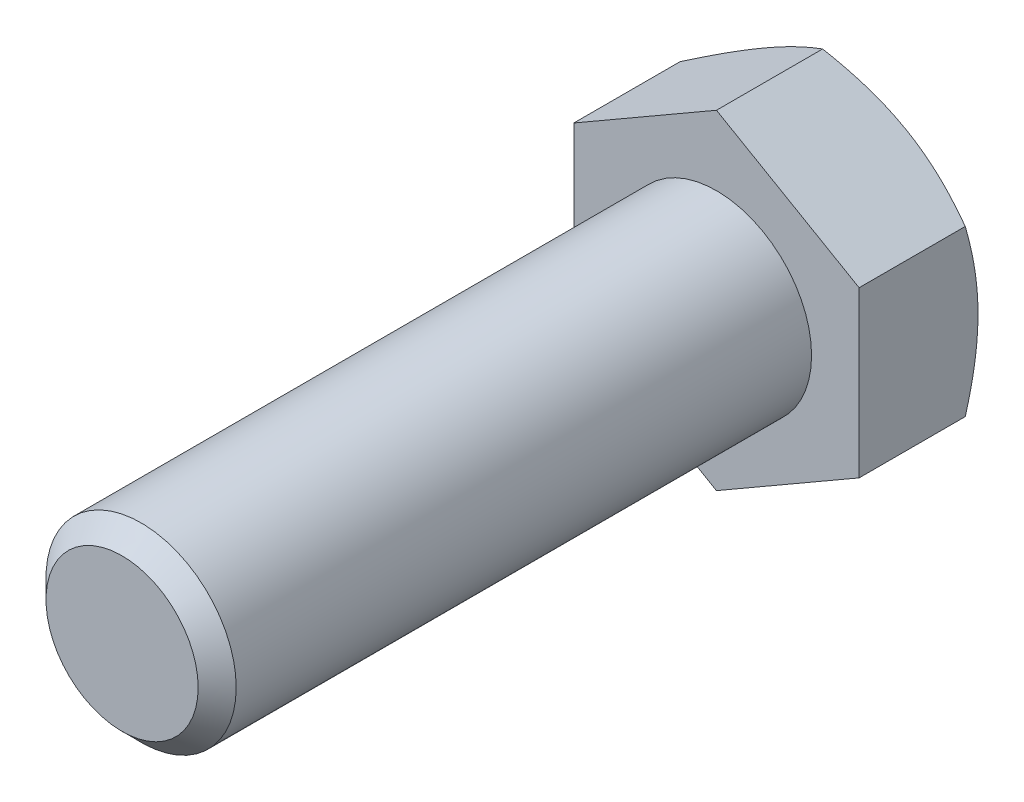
ISO-10303-21;
HEADER;
FILE_DESCRIPTION(('STEP AP214'),'2;1');
FILE_NAME('part.step','',(''),(''),'','','');
FILE_SCHEMA(('AUTOMOTIVE_DESIGN { 1 0 10303 214 1 1 1 1 }'));
ENDSEC;
DATA;
#1=APPLICATION_CONTEXT('core data for automotive mechanical design processes');
#2=APPLICATION_PROTOCOL_DEFINITION('international standard','automotive_design',2000,#1);
#3=PRODUCT_CONTEXT('',#1,'mechanical');
#4=PRODUCT('Part','Part','',(#3));
#5=PRODUCT_RELATED_PRODUCT_CATEGORY('part','',(#4));
#6=PRODUCT_DEFINITION_FORMATION('','',#4);
#7=PRODUCT_DEFINITION_CONTEXT('part definition',#1,'design');
#8=PRODUCT_DEFINITION('design','',#6,#7);
#9=PRODUCT_DEFINITION_SHAPE('','',#8);
#10=(LENGTH_UNIT() NAMED_UNIT(*) SI_UNIT(.MILLI.,.METRE.));
#11=(NAMED_UNIT(*) PLANE_ANGLE_UNIT() SI_UNIT($,.RADIAN.));
#12=(NAMED_UNIT(*) SI_UNIT($,.STERADIAN.) SOLID_ANGLE_UNIT());
#13=UNCERTAINTY_MEASURE_WITH_UNIT(LENGTH_MEASURE(1.E-05),#10,'distance_accuracy_value','');
#14=(GEOMETRIC_REPRESENTATION_CONTEXT(3) GLOBAL_UNCERTAINTY_ASSIGNED_CONTEXT((#13)) GLOBAL_UNIT_ASSIGNED_CONTEXT((#10,
#11,#12)) REPRESENTATION_CONTEXT('',''));
#15=CARTESIAN_POINT('',(0.,0.,0.));
#16=DIRECTION('',(0.,0.,1.));
#17=DIRECTION('',(1.,0.,0.));
#18=AXIS2_PLACEMENT_3D('',#15,#16,#17);
#19=CARTESIAN_POINT('',(3.7470027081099E-13,0.,50.));
#20=DIRECTION('',(0.,0.,1.));
#21=DIRECTION('',(1.,0.,0.));
#22=AXIS2_PLACEMENT_3D('',#19,#20,#21);
#23=PLANE('',#22);
#24=CARTESIAN_POINT('',(3.7470027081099E-13,0.,50.));
#25=DIRECTION('',(0.,0.,1.));
#26=DIRECTION('',(1.,0.,0.));
#27=AXIS2_PLACEMENT_3D('',#24,#25,#26);
#28=CIRCLE('',#27,6.40000000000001);
#29=CARTESIAN_POINT('',(6.40000000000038,0.,50.));
#30=VERTEX_POINT('',#29);
#31=EDGE_CURVE('E204',#30,#30,#28,.T.);
#32=ORIENTED_EDGE('',*,*,#31,.T.);
#33=EDGE_LOOP('',(#32));
#34=FACE_BOUND('',#33,.T.);
#35=ADVANCED_FACE('F30',(#34),#23,.T.);
#36=CARTESIAN_POINT('',(0.,0.,0.));
#37=DIRECTION('',(0.,0.,1.));
#38=DIRECTION('',(1.,0.,0.));
#39=AXIS2_PLACEMENT_3D('',#36,#37,#38);
#40=CYLINDRICAL_SURFACE('',#39,8.);
#41=CARTESIAN_POINT('',(2.63677968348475E-13,0.,48.4));
#42=DIRECTION('',(0.,0.,1.));
#43=DIRECTION('',(1.,0.,0.));
#44=AXIS2_PLACEMENT_3D('',#41,#42,#43);
#45=CIRCLE('',#44,8.);
#46=CARTESIAN_POINT('',(8.00000000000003,0.,48.4));
#47=VERTEX_POINT('',#46);
#48=EDGE_CURVE('E206',#47,#47,#45,.F.);
#49=CARTESIAN_POINT('',(0.,0.,0.));
#50=DIRECTION('',(0.,0.,1.));
#51=DIRECTION('',(0.999999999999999,0.,0.));
#52=AXIS2_PLACEMENT_3D('',#49,#50,#51);
#53=CIRCLE('',#52,8.);
#54=CARTESIAN_POINT('',(8.,0.,0.));
#55=VERTEX_POINT('',#54);
#56=EDGE_CURVE('E207',#55,#55,#53,.F.);
#57=CARTESIAN_POINT('',(8.00000000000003,0.,48.4));
#58=CARTESIAN_POINT('',(8.00000000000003,0.,47.8958333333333));
#59=CARTESIAN_POINT('',(8.00000000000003,0.,47.3916666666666));
#60=CARTESIAN_POINT('',(8.00000000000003,0.,46.3833333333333));
#61=CARTESIAN_POINT('',(8.00000000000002,0.,45.8791666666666));
#62=CARTESIAN_POINT('',(8.00000000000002,0.,44.8708333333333));
#63=CARTESIAN_POINT('',(8.00000000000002,0.,44.3666666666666));
#64=CARTESIAN_POINT('',(8.00000000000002,0.,43.3583333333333));
#65=CARTESIAN_POINT('',(8.00000000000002,0.,42.8541666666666));
#66=CARTESIAN_POINT('',(8.00000000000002,0.,41.8458333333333));
#67=CARTESIAN_POINT('',(8.00000000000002,0.,41.3416666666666));
#68=CARTESIAN_POINT('',(8.00000000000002,0.,40.3333333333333));
#69=CARTESIAN_POINT('',(8.00000000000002,0.,39.8291666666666));
#70=CARTESIAN_POINT('',(8.00000000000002,0.,38.8208333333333));
#71=CARTESIAN_POINT('',(8.00000000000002,0.,38.3166666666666));
#72=CARTESIAN_POINT('',(8.00000000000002,0.,37.3083333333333));
#73=CARTESIAN_POINT('',(8.00000000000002,0.,36.8041666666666));
#74=CARTESIAN_POINT('',(8.00000000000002,0.,35.7958333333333));
#75=CARTESIAN_POINT('',(8.00000000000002,0.,35.2916666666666));
#76=CARTESIAN_POINT('',(8.00000000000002,0.,34.2833333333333));
#77=CARTESIAN_POINT('',(8.00000000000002,0.,33.7791666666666));
#78=CARTESIAN_POINT('',(8.00000000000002,0.,32.7708333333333));
#79=CARTESIAN_POINT('',(8.00000000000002,0.,32.2666666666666));
#80=CARTESIAN_POINT('',(8.00000000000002,0.,31.2583333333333));
#81=CARTESIAN_POINT('',(8.00000000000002,0.,30.7541666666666));
#82=CARTESIAN_POINT('',(8.00000000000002,0.,29.7458333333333));
#83=CARTESIAN_POINT('',(8.00000000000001,0.,29.2416666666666));
#84=CARTESIAN_POINT('',(8.00000000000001,0.,28.2333333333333));
#85=CARTESIAN_POINT('',(8.00000000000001,0.,27.7291666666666));
#86=CARTESIAN_POINT('',(8.00000000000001,0.,26.7208333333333));
#87=CARTESIAN_POINT('',(8.00000000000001,0.,26.2166666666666));
#88=CARTESIAN_POINT('',(8.00000000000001,0.,25.2083333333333));
#89=CARTESIAN_POINT('',(8.00000000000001,0.,24.7041666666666));
#90=CARTESIAN_POINT('',(8.00000000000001,0.,23.6958333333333));
#91=CARTESIAN_POINT('',(8.00000000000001,0.,23.1916666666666));
#92=CARTESIAN_POINT('',(8.00000000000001,0.,22.1833333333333));
#93=CARTESIAN_POINT('',(8.00000000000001,0.,21.6791666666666));
#94=CARTESIAN_POINT('',(8.00000000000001,0.,20.6708333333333));
#95=CARTESIAN_POINT('',(8.00000000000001,0.,20.1666666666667));
#96=CARTESIAN_POINT('',(8.00000000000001,0.,19.1583333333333));
#97=CARTESIAN_POINT('',(8.00000000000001,0.,18.6541666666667));
#98=CARTESIAN_POINT('',(8.00000000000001,0.,17.6458333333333));
#99=CARTESIAN_POINT('',(8.00000000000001,0.,17.1416666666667));
#100=CARTESIAN_POINT('',(8.00000000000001,0.,16.1333333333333));
#101=CARTESIAN_POINT('',(8.00000000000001,0.,15.6291666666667));
#102=CARTESIAN_POINT('',(8.00000000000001,0.,14.6208333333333));
#103=CARTESIAN_POINT('',(8.00000000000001,0.,14.1166666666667));
#104=CARTESIAN_POINT('',(8.00000000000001,0.,13.1083333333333));
#105=CARTESIAN_POINT('',(8.,0.,12.6041666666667));
#106=CARTESIAN_POINT('',(8.,0.,11.5958333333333));
#107=CARTESIAN_POINT('',(8.,0.,11.0916666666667));
#108=CARTESIAN_POINT('',(8.,0.,10.0833333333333));
#109=CARTESIAN_POINT('',(8.,0.,9.57916666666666));
#110=CARTESIAN_POINT('',(8.,0.,8.57083333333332));
#111=CARTESIAN_POINT('',(8.,0.,8.06666666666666));
#112=CARTESIAN_POINT('',(8.,0.,7.05833333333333));
#113=CARTESIAN_POINT('',(8.,0.,6.55416666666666));
#114=CARTESIAN_POINT('',(8.,0.,5.54583333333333));
#115=CARTESIAN_POINT('',(8.,0.,5.04166666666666));
#116=CARTESIAN_POINT('',(8.,0.,4.03333333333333));
#117=CARTESIAN_POINT('',(8.,0.,3.52916666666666));
#118=CARTESIAN_POINT('',(8.,0.,2.52083333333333));
#119=CARTESIAN_POINT('',(8.,0.,2.01666666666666));
#120=CARTESIAN_POINT('',(8.,0.,1.00833333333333));
#121=CARTESIAN_POINT('',(8.,0.,0.504166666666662));
#122=CARTESIAN_POINT('',(8.,0.,0.));
#123=B_SPLINE_CURVE_WITH_KNOTS('',3,(#57,#58,#59,#60,#61,#62,#63,#64,#65,#66,#67,#68,#69,#70,
#71,#72,#73,#74,#75,#76,#77,#78,#79,#80,#81,#82,#83,#84,#85,#86,#87,#88,#89,#90,#91,#92,#93,#94,
#95,#96,#97,#98,#99,#100,#101,#102,#103,#104,#105,#106,#107,#108,#109,#110,#111,#112,#113,#114,
#115,#116,#117,#118,#119,#120,#121,#122),.UNSPECIFIED.,.F.,.F.,(4,2,2,2,2,2,2,2,2,2,2,2,2,2,2,2,
2,2,2,2,2,2,2,2,2,2,2,2,2,2,2,2,4),(0.,1.5125,3.02499999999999,4.53749999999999,
6.04999999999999,7.56249999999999,9.07499999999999,10.5875,12.1,13.6125,15.125,16.6375,18.15,
19.6625,21.175,22.6875,24.2,25.7125,27.225,28.7375,30.25,31.7625,33.275,34.7875,36.3,37.8125,
39.325,40.8375,42.35,43.8625,45.375,46.8875,48.4),.UNSPECIFIED.);
#124=EDGE_CURVE('BSEAM195',#47,#55,#123,.T.);
#125=ORIENTED_EDGE('',*,*,#48,.T.);
#126=ORIENTED_EDGE('',*,*,#56,.F.);
#127=ORIENTED_EDGE('',*,*,#124,.T.);
#128=ORIENTED_EDGE('',*,*,#124,.F.);
#129=EDGE_LOOP('',(#125,#127,#126,#128));
#130=FACE_BOUND('',#129,.T.);
#131=ADVANCED_FACE('F195',(#130),#40,.T.);
#132=CARTESIAN_POINT('',(3.7470027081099E-13,0.,50.));
#133=DIRECTION('',(0.,0.,-1.));
#134=DIRECTION('',(-1.,0.,0.));
#135=AXIS2_PLACEMENT_3D('',#132,#133,#134);
#136=CONICAL_SURFACE('',#135,6.40000000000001,0.785398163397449);
#137=ORIENTED_EDGE('',*,*,#48,.F.);
#138=EDGE_LOOP('',(#137));
#139=FACE_BOUND('',#138,.T.);
#140=ORIENTED_EDGE('',*,*,#31,.F.);
#141=EDGE_LOOP('',(#140));
#142=FACE_BOUND('',#141,.T.);
#143=ADVANCED_FACE('F200',(#139,#142),#136,.T.);
#144=CARTESIAN_POINT('',(1.14491749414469E-13,13.8564064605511,-9.99999999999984));
#145=DIRECTION('',(0.499999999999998,0.866025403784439,0.));
#146=DIRECTION('',(-0.86602540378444,0.499999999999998,0.));
#147=AXIS2_PLACEMENT_3D('',#144,#145,#146);
#148=PLANE('',#147);
#149=CARTESIAN_POINT('',(-0.000200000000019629,13.8565219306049,-8.92813656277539));
#150=CARTESIAN_POINT('',(0.263585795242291,13.7042251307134,-9.01605036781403));
#151=CARTESIAN_POINT('',(0.528355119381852,13.5513604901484,-9.09997400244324));
#152=CARTESIAN_POINT('',(1.06001701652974,13.2444053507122,-9.25873378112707));
#153=CARTESIAN_POINT('',(1.32691025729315,13.0903144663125,-9.33356693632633));
#154=CARTESIAN_POINT('',(2.13189040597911,12.6255589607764,-9.54298246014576));
#155=CARTESIAN_POINT('',(2.67315507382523,12.3130596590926,-9.66209676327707));
#156=CARTESIAN_POINT('',(3.48313282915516,11.8454187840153,-9.80176893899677));
#157=CARTESIAN_POINT('',(3.74942610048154,11.6916742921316,-9.84155620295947));
#158=CARTESIAN_POINT('',(4.28324559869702,11.3834734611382,-9.90827663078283));
#159=CARTESIAN_POINT('',(4.55077184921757,11.2290171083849,-9.93520954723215));
#160=CARTESIAN_POINT('',(5.08627036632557,10.9198468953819,-9.97553140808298));
#161=CARTESIAN_POINT('',(5.35424172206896,10.7651335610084,-9.98893644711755));
#162=CARTESIAN_POINT('',(5.89043273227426,10.4555635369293,-10.0019169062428));
#163=CARTESIAN_POINT('',(6.15865237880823,10.3007068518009,-10.0014927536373));
#164=CARTESIAN_POINT('',(6.6600893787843,10.0112020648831,-9.98777998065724));
#165=CARTESIAN_POINT('',(6.89334249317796,9.87653331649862,-9.97616401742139));
#166=CARTESIAN_POINT('',(7.35931224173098,9.60750555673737,-9.94269199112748));
#167=CARTESIAN_POINT('',(7.59202883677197,9.47314656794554,-9.92083520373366));
#168=CARTESIAN_POINT('',(8.05679907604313,9.204811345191,-9.86726258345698));
#169=CARTESIAN_POINT('',(8.28885201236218,9.07083551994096,-9.83553860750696));
#170=CARTESIAN_POINT('',(8.75186996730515,8.80351197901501,-9.76278822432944));
#171=CARTESIAN_POINT('',(8.9828349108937,8.67016430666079,-9.72176118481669));
#172=CARTESIAN_POINT('',(9.68394195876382,8.26537996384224,-9.58368834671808));
#173=CARTESIAN_POINT('',(10.1520537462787,7.99511549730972,-9.47287511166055));
#174=CARTESIAN_POINT('',(11.0812971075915,7.45861659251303,-9.22137423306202));
#175=CARTESIAN_POINT('',(11.5424405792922,7.19237528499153,-9.08074565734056));
#176=CARTESIAN_POINT('',(12.0002,6.92808776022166,-8.92813656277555));
#177=B_SPLINE_CURVE_WITH_KNOTS('',3,(#149,#150,#151,#152,#153,#154,#155,#156,#157,#158,#159,
#160,#161,#162,#163,#164,#165,#166,#167,#168,#169,#170,#171,#172,#173,#174,#175,#176),
.UNSPECIFIED.,.F.,.F.,(4,2,2,2,2,2,2,2,2,2,2,2,2,4),(0.,0.951004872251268,1.90232158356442,
3.8090046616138,4.73894551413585,5.66890426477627,6.59775529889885,7.52657763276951,
8.33514643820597,9.14377244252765,9.95306755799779,10.7624176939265,12.4167102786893,
14.0677556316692),.UNSPECIFIED.);
#178=CARTESIAN_POINT('',(0.,13.8564064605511,-8.92820323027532));
#179=VERTEX_POINT('',#178);
#180=CARTESIAN_POINT('',(6.00000000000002,10.3923048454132,-10.));
#181=VERTEX_POINT('',#180);
#182=EDGE_CURVE('E240',#179,#181,#177,.T.);
#183=ORIENTED_EDGE('',*,*,#182,.F.);
#184=DIRECTION('',(0.,0.,1.));
#185=VECTOR('',#184,1.);
#186=CARTESIAN_POINT('',(1.14491749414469E-13,13.8564064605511,-9.99999999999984));
#187=LINE('',#186,#185);
#188=CARTESIAN_POINT('',(1.2490009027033E-13,13.8564064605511,1.66533453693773E-13));
#189=VERTEX_POINT('',#188);
#190=EDGE_CURVE('E214',#179,#189,#187,.T.);
#191=ORIENTED_EDGE('',*,*,#190,.T.);
#192=DIRECTION('',(-0.86602540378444,0.499999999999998,0.));
#193=VECTOR('',#192,1.);
#194=CARTESIAN_POINT('',(1.2490009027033E-13,13.8564064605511,1.66533453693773E-13));
#195=LINE('',#194,#193);
#196=CARTESIAN_POINT('',(12.0000000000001,6.92820323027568,0.));
#197=VERTEX_POINT('',#196);
#198=EDGE_CURVE('E238',#197,#189,#195,.T.);
#199=ORIENTED_EDGE('',*,*,#198,.F.);
#200=DIRECTION('',(0.,0.,1.));
#201=VECTOR('',#200,1.);
#202=CARTESIAN_POINT('',(12.,6.92820323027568,-9.99999999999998));
#203=LINE('',#202,#201);
#204=CARTESIAN_POINT('',(12.,6.92820323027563,-8.92820323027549));
#205=VERTEX_POINT('',#204);
#206=EDGE_CURVE('E211',#205,#197,#203,.T.);
#207=ORIENTED_EDGE('',*,*,#206,.F.);
#208=EDGE_CURVE('E170',#181,#205,#177,.T.);
#209=ORIENTED_EDGE('',*,*,#208,.F.);
#210=EDGE_LOOP('',(#183,#191,#199,#207,#209));
#211=FACE_BOUND('',#210,.T.);
#212=ADVANCED_FACE('F180',(#211),#148,.T.);
#213=CARTESIAN_POINT('',(12.0000000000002,-6.92820323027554,-10.));
#214=DIRECTION('',(0.999999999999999,0.,0.));
#215=DIRECTION('',(0.,0.,-1.));
#216=AXIS2_PLACEMENT_3D('',#213,#214,#215);
#217=PLANE('',#216);
#218=CARTESIAN_POINT('',(12.0000000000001,-18.9250739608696,-3.99042361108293));
#219=CARTESIAN_POINT('',(12.0000000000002,-18.6616294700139,-4.11887459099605));
#220=CARTESIAN_POINT('',(12.0000000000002,-18.3978841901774,-4.24670838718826));
#221=CARTESIAN_POINT('',(12.0000000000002,-17.869729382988,-4.50100240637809));
#222=CARTESIAN_POINT('',(12.0000000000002,-17.6053198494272,-4.62746261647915));
#223=CARTESIAN_POINT('',(12.0000000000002,-16.8109346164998,-5.00460542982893));
#224=CARTESIAN_POINT('',(12.0000000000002,-16.2798755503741,-5.25301439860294));
#225=CARTESIAN_POINT('',(12.0000000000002,-15.2115652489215,-5.74359590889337));
#226=CARTESIAN_POINT('',(12.0000000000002,-14.6742962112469,-5.98572977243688));
#227=CARTESIAN_POINT('',(12.0000000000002,-13.5955935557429,-6.46050256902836));
#228=CARTESIAN_POINT('',(12.0000000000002,-13.054160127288,-6.69314193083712));
#229=CARTESIAN_POINT('',(12.0000000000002,-11.9477551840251,-7.15413664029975));
#230=CARTESIAN_POINT('',(12.0000000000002,-11.3826097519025,-7.38207667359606));
#231=CARTESIAN_POINT('',(12.0000000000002,-10.2458209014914,-7.82145679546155));
#232=CARTESIAN_POINT('',(12.0000000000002,-9.67417677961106,-8.03289507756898));
#233=CARTESIAN_POINT('',(12.0000000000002,-8.5244701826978,-8.43394793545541));
#234=CARTESIAN_POINT('',(12.0000000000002,-7.94642231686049,-8.62360406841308));
#235=CARTESIAN_POINT('',(12.0000000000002,-6.78198793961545,-8.97522909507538));
#236=CARTESIAN_POINT('',(12.0000000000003,-6.19560401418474,-9.13720638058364));
#237=CARTESIAN_POINT('',(12.0000000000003,-5.31125301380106,-9.35327296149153));
#238=CARTESIAN_POINT('',(12.0000000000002,-5.01651684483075,-9.42065839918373));
#239=CARTESIAN_POINT('',(12.0000000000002,-4.42497462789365,-9.54568693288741));
#240=CARTESIAN_POINT('',(12.0000000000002,-4.1281686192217,-9.60333021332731));
#241=CARTESIAN_POINT('',(12.0000000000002,-3.53266972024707,-9.70787722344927));
#242=CARTESIAN_POINT('',(12.0000000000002,-3.23397688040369,-9.75478123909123));
#243=CARTESIAN_POINT('',(12.0000000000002,-2.63499315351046,-9.83692742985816));
#244=CARTESIAN_POINT('',(12.0000000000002,-2.33470233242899,-9.87217008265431));
#245=CARTESIAN_POINT('',(12.0000000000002,-1.7370004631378,-9.92983318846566));
#246=CARTESIAN_POINT('',(12.0000000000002,-1.43960568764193,-9.95242127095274));
#247=CARTESIAN_POINT('',(12.0000000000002,-0.844126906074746,-9.98498816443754));
#248=CARTESIAN_POINT('',(12.0000000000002,-0.546042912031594,-9.99496719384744));
#249=CARTESIAN_POINT('',(12.0000000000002,0.0502829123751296,-10.0020768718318));
#250=CARTESIAN_POINT('',(12.0000000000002,0.34852474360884,-9.99920744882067));
#251=CARTESIAN_POINT('',(12.0000000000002,0.944614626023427,-9.98069357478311));
#252=CARTESIAN_POINT('',(12.0000000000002,1.24246265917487,-9.96504855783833));
#253=CARTESIAN_POINT('',(12.0000000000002,1.94883669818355,-9.91313385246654));
#254=CARTESIAN_POINT('',(12.0000000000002,2.35696532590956,-9.87132867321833));
#255=CARTESIAN_POINT('',(12.0000000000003,3.17037872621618,-9.76594124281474));
#256=CARTESIAN_POINT('',(12.0000000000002,3.57566314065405,-9.70235629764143));
#257=CARTESIAN_POINT('',(12.0000000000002,4.78667114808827,-9.48228853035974));
#258=CARTESIAN_POINT('',(12.0000000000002,5.58715478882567,-9.29652578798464));
#259=CARTESIAN_POINT('',(12.0000000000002,6.78477534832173,-8.97197381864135));
#260=CARTESIAN_POINT('',(12.0000000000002,7.18805346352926,-8.85452170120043));
#261=CARTESIAN_POINT('',(12.0000000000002,7.99069893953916,-8.60681919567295));
#262=CARTESIAN_POINT('',(12.0000000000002,8.39006626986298,-8.47656870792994));
#263=CARTESIAN_POINT('',(12.0000000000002,9.1850074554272,-8.20540698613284));
#264=CARTESIAN_POINT('',(12.0000000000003,9.58058232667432,-8.06449870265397));
#265=CARTESIAN_POINT('',(12.0000000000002,10.3684152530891,-7.77374558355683));
#266=CARTESIAN_POINT('',(12.0000000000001,10.7606733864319,-7.62390095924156));
#267=CARTESIAN_POINT('',(12.0000000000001,11.4875161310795,-7.3382354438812));
#268=CARTESIAN_POINT('',(12.0000000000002,11.8224853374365,-7.20338895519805));
#269=CARTESIAN_POINT('',(12.0000000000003,12.4904657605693,-6.92892402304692));
#270=CARTESIAN_POINT('',(12.0000000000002,12.8234769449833,-6.78930550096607));
#271=CARTESIAN_POINT('',(12.0000000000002,13.8199414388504,-6.36427464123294));
#272=CARTESIAN_POINT('',(12.0000000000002,14.4807713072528,-6.07270863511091));
#273=CARTESIAN_POINT('',(12.0000000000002,15.7970784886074,-5.47713534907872));
#274=CARTESIAN_POINT('',(12.0000000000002,16.4525535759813,-5.1731231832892));
#275=CARTESIAN_POINT('',(12.0000000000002,17.7589886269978,-4.5556392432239));
#276=CARTESIAN_POINT('',(12.0000000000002,18.4099487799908,-4.2421678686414));
#277=CARTESIAN_POINT('',(12.0000000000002,19.7093218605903,-3.60732416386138));
#278=CARTESIAN_POINT('',(12.0000000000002,20.357728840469,-3.28593969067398));
#279=CARTESIAN_POINT('',(12.0000000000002,21.6516057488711,-2.63730730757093));
#280=CARTESIAN_POINT('',(12.0000000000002,22.2970756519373,-2.3100593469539));
#281=CARTESIAN_POINT('',(12.0000000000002,23.5854613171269,-1.65093387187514));
#282=CARTESIAN_POINT('',(12.0000000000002,24.2283776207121,-1.31905741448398));
#283=CARTESIAN_POINT('',(12.0000000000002,25.5122149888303,-0.651476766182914));
#284=CARTESIAN_POINT('',(12.0000000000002,26.1531360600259,-0.315772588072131));
#285=CARTESIAN_POINT('',(12.0000000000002,27.9362828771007,0.623783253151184));
#286=CARTESIAN_POINT('',(12.0000000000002,29.0767003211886,1.23106608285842));
#287=CARTESIAN_POINT('',(12.0000000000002,31.3537253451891,2.45288949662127));
#288=CARTESIAN_POINT('',(12.0000000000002,32.4903326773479,3.06743054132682));
#289=CARTESIAN_POINT('',(12.0000000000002,34.7567241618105,4.29980771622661));
#290=CARTESIAN_POINT('',(12.0000000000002,35.8865183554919,4.91762539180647));
#291=CARTESIAN_POINT('',(12.0000000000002,37.5794668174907,5.84741408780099));
#292=CARTESIAN_POINT('',(12.0000000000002,38.1434699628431,6.15784153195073));
#293=CARTESIAN_POINT('',(12.0000000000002,39.2709710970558,6.77961088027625));
#294=CARTESIAN_POINT('',(12.0000000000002,39.8344690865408,7.09095278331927));
#295=CARTESIAN_POINT('',(12.,40.3977455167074,7.40269511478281));
#296=B_SPLINE_CURVE_WITH_KNOTS('',3,(#218,#219,#220,#221,#222,#223,#224,#225,#226,#227,#228,
#229,#230,#231,#232,#233,#234,#235,#236,#237,#238,#239,#240,#241,#242,#243,#244,#245,#246,#247,
#248,#249,#250,#251,#252,#253,#254,#255,#256,#257,#258,#259,#260,#261,#262,#263,#264,#265,#266,
#267,#268,#269,#270,#271,#272,#273,#274,#275,#276,#277,#278,#279,#280,#281,#282,#283,#284,#285,
#286,#287,#288,#289,#290,#291,#292,#293,#294,#295),.UNSPECIFIED.,.F.,.F.,(4,2,2,2,2,2,2,2,2,2,2,
2,2,2,2,2,2,2,2,2,2,2,2,2,2,2,2,2,2,2,2,2,2,2,2,2,2,2,4),(0.,0.879273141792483,1.75855453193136,
3.51736195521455,5.28522162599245,7.05300137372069,8.88094951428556,10.7090974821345,
12.5336975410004,14.357743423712,15.264632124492,16.1715036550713,17.0783510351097,
17.9851612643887,18.8796567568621,19.7741367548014,20.6686217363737,21.5631463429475,
22.7932504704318,24.0235068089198,26.4852023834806,27.7451892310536,29.0051858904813,
30.2648349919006,31.5244543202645,32.6076922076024,33.6909479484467,35.8576349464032,
38.0251808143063,40.1926352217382,42.3636532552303,44.5346900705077,46.7052389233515,
48.8757805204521,52.7518329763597,56.6281327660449,60.491176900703,62.4225443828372,
64.3539094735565),.UNSPECIFIED.);
#297=CARTESIAN_POINT('',(12.0000000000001,0.,-10.));
#298=VERTEX_POINT('',#297);
#299=EDGE_CURVE('E168',#205,#298,#296,.F.);
#300=ORIENTED_EDGE('',*,*,#299,.F.);
#301=ORIENTED_EDGE('',*,*,#206,.T.);
#302=DIRECTION('',(0.,0.999999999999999,0.));
#303=VECTOR('',#302,1.);
#304=CARTESIAN_POINT('',(12.0000000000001,-6.92820323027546,0.));
#305=LINE('',#304,#303);
#306=CARTESIAN_POINT('',(12.0000000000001,-6.92820323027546,0.));
#307=VERTEX_POINT('',#306);
#308=EDGE_CURVE('E216',#307,#197,#305,.T.);
#309=ORIENTED_EDGE('',*,*,#308,.F.);
#310=DIRECTION('',(0.,0.,1.));
#311=VECTOR('',#310,1.);
#312=CARTESIAN_POINT('',(12.0000000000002,-6.92820323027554,-10.));
#313=LINE('',#312,#311);
#314=CARTESIAN_POINT('',(12.0000000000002,-6.92820323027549,-8.92820323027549));
#315=VERTEX_POINT('',#314);
#316=EDGE_CURVE('E222',#315,#307,#313,.T.);
#317=ORIENTED_EDGE('',*,*,#316,.F.);
#318=EDGE_CURVE('E163',#298,#315,#296,.F.);
#319=ORIENTED_EDGE('',*,*,#318,.F.);
#320=EDGE_LOOP('',(#300,#301,#309,#317,#319));
#321=FACE_BOUND('',#320,.T.);
#322=ADVANCED_FACE('F176',(#321),#217,.T.);
#323=CARTESIAN_POINT('',(0.,-13.8564064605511,-10.));
#324=DIRECTION('',(0.499999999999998,-0.86602540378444,0.));
#325=DIRECTION('',(0.86602540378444,0.499999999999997,0.));
#326=AXIS2_PLACEMENT_3D('',#323,#324,#325);
#327=PLANE('',#326);
#328=CARTESIAN_POINT('',(12.0002000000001,-6.92808776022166,-8.92813656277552));
#329=CARTESIAN_POINT('',(11.7364142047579,-7.08038456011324,-9.01605036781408));
#330=CARTESIAN_POINT('',(11.4716448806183,-7.23324920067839,-9.09997400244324));
#331=CARTESIAN_POINT('',(10.9399829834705,-7.54020434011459,-9.25873378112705));
#332=CARTESIAN_POINT('',(10.6730897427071,-7.69429522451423,-9.33356693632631));
#333=CARTESIAN_POINT('',(9.86810959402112,-8.15905073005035,-9.54298246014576));
#334=CARTESIAN_POINT('',(9.32684492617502,-8.47155003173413,-9.66209676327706));
#335=CARTESIAN_POINT('',(8.51686717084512,-8.93919090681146,-9.80176893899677));
#336=CARTESIAN_POINT('',(8.25057389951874,-9.09293539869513,-9.84155620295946));
#337=CARTESIAN_POINT('',(7.71675440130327,-9.4011362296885,-9.90827663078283));
#338=CARTESIAN_POINT('',(7.44922815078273,-9.55559258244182,-9.93520954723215));
#339=CARTESIAN_POINT('',(6.91372963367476,-9.86476279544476,-9.97553140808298));
#340=CARTESIAN_POINT('',(6.64575827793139,-10.0194761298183,-9.98893644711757));
#341=CARTESIAN_POINT('',(6.10956726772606,-10.3290461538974,-10.0019169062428));
#342=CARTESIAN_POINT('',(5.84134762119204,-10.4839028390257,-10.0014927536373));
#343=CARTESIAN_POINT('',(5.33991062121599,-10.7734076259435,-9.98777998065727));
#344=CARTESIAN_POINT('',(5.10665750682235,-10.908076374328,-9.97616401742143));
#345=CARTESIAN_POINT('',(4.64068775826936,-11.1771041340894,-9.94269199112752));
#346=CARTESIAN_POINT('',(4.40797116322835,-11.3114631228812,-9.9208352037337));
#347=CARTESIAN_POINT('',(3.94320092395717,-11.5797983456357,-9.86726258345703));
#348=CARTESIAN_POINT('',(3.71114798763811,-11.7137741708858,-9.83553860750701));
#349=CARTESIAN_POINT('',(3.24813003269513,-11.9810977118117,-9.76278822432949));
#350=CARTESIAN_POINT('',(3.01716508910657,-12.1144453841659,-9.72176118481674));
#351=CARTESIAN_POINT('',(2.31605804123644,-12.5192297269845,-9.58368834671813));
#352=CARTESIAN_POINT('',(1.84794625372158,-12.7894941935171,-9.4728751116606));
#353=CARTESIAN_POINT('',(0.91870289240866,-13.3259930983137,-9.22137423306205));
#354=CARTESIAN_POINT('',(0.457559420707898,-13.5922344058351,-9.08074565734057));
#355=CARTESIAN_POINT('',(-0.000200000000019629,-13.8565219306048,-8.92813656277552));
#356=B_SPLINE_CURVE_WITH_KNOTS('',3,(#328,#329,#330,#331,#332,#333,#334,#335,#336,#337,#338,
#339,#340,#341,#342,#343,#344,#345,#346,#347,#348,#349,#350,#351,#352,#353,#354,#355),
.UNSPECIFIED.,.F.,.F.,(4,2,2,2,2,2,2,2,2,2,2,2,2,4),(0.,0.951004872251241,1.90232158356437,
3.8090046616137,4.73894551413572,5.66890426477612,6.59775529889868,7.52657763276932,
8.3351464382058,9.1437724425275,9.95306755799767,10.7624176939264,12.4167102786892,
14.0677556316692),.UNSPECIFIED.);
#357=CARTESIAN_POINT('',(6.00000000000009,-10.3923048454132,-10.));
#358=VERTEX_POINT('',#357);
#359=EDGE_CURVE('E169',#315,#358,#356,.T.);
#360=ORIENTED_EDGE('',*,*,#359,.F.);
#361=ORIENTED_EDGE('',*,*,#316,.T.);
#362=DIRECTION('',(0.86602540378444,0.499999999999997,0.));
#363=VECTOR('',#362,1.);
#364=CARTESIAN_POINT('',(0.,-13.856406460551,0.));
#365=LINE('',#364,#363);
#366=CARTESIAN_POINT('',(0.,-13.856406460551,0.));
#367=VERTEX_POINT('',#366);
#368=EDGE_CURVE('E227',#367,#307,#365,.T.);
#369=ORIENTED_EDGE('',*,*,#368,.F.);
#370=DIRECTION('',(0.,0.,1.));
#371=VECTOR('',#370,1.);
#372=CARTESIAN_POINT('',(0.,-13.8564064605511,-10.));
#373=LINE('',#372,#371);
#374=CARTESIAN_POINT('',(0.,-13.8564064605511,-8.92820323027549));
#375=VERTEX_POINT('',#374);
#376=EDGE_CURVE('E220',#375,#367,#373,.T.);
#377=ORIENTED_EDGE('',*,*,#376,.F.);
#378=EDGE_CURVE('E157',#358,#375,#356,.T.);
#379=ORIENTED_EDGE('',*,*,#378,.F.);
#380=EDGE_LOOP('',(#360,#361,#369,#377,#379));
#381=FACE_BOUND('',#380,.T.);
#382=ADVANCED_FACE('F179',(#381),#327,.T.);
#383=CARTESIAN_POINT('',(0.,-13.8564064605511,-10.));
#384=DIRECTION('',(-0.500000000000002,-0.866025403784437,0.));
#385=DIRECTION('',(0.866025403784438,-0.500000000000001,0.));
#386=AXIS2_PLACEMENT_3D('',#383,#384,#385);
#387=PLANE('',#386);
#388=CARTESIAN_POINT('',(0.000200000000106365,-13.8565219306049,-8.92813656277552));
#389=CARTESIAN_POINT('',(-0.263585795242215,-13.7042251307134,-9.01605036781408));
#390=CARTESIAN_POINT('',(-0.52835511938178,-13.5513604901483,-9.09997400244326));
#391=CARTESIAN_POINT('',(-1.06001701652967,-13.2444053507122,-9.25873378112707));
#392=CARTESIAN_POINT('',(-1.32691025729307,-13.0903144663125,-9.33356693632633));
#393=CARTESIAN_POINT('',(-2.13189040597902,-12.6255589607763,-9.54298246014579));
#394=CARTESIAN_POINT('',(-2.67315507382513,-12.3130596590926,-9.66209676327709));
#395=CARTESIAN_POINT('',(-3.48313282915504,-11.8454187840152,-9.8017689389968));
#396=CARTESIAN_POINT('',(-3.74942610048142,-11.6916742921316,-9.8415562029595));
#397=CARTESIAN_POINT('',(-4.2832455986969,-11.3834734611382,-9.90827663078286));
#398=CARTESIAN_POINT('',(-4.55077184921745,-11.2290171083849,-9.93520954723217));
#399=CARTESIAN_POINT('',(-5.08627036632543,-10.9198468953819,-9.97553140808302));
#400=CARTESIAN_POINT('',(-5.35424172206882,-10.7651335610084,-9.98893644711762));
#401=CARTESIAN_POINT('',(-5.89043273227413,-10.4555635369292,-10.0019169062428));
#402=CARTESIAN_POINT('',(-6.1586523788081,-10.3007068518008,-10.0014927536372));
#403=CARTESIAN_POINT('',(-6.66008937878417,-10.011202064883,-9.98777998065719));
#404=CARTESIAN_POINT('',(-6.89334249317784,-9.87653331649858,-9.97616401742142));
#405=CARTESIAN_POINT('',(-7.35931224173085,-9.60750555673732,-9.94269199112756));
#406=CARTESIAN_POINT('',(-7.59202883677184,-9.47314656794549,-9.92083520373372));
#407=CARTESIAN_POINT('',(-8.056799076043,-9.20481134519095,-9.86726258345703));
#408=CARTESIAN_POINT('',(-8.28885201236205,-9.07083551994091,-9.83553860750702));
#409=CARTESIAN_POINT('',(-8.75186996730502,-8.80351197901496,-9.7627882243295));
#410=CARTESIAN_POINT('',(-8.98283491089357,-8.67016430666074,-9.72176118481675));
#411=CARTESIAN_POINT('',(-9.68394195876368,-8.26537996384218,-9.58368834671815));
#412=CARTESIAN_POINT('',(-10.1520537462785,-7.99511549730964,-9.47287511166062));
#413=CARTESIAN_POINT('',(-11.0812971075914,-7.45861659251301,-9.22137423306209));
#414=CARTESIAN_POINT('',(-11.5424405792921,-7.1923752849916,-9.08074565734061));
#415=CARTESIAN_POINT('',(-12.0002,-6.92808776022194,-8.92813656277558));
#416=B_SPLINE_CURVE_WITH_KNOTS('',3,(#388,#389,#390,#391,#392,#393,#394,#395,#396,#397,#398,
#399,#400,#401,#402,#403,#404,#405,#406,#407,#408,#409,#410,#411,#412,#413,#414,#415),
.UNSPECIFIED.,.F.,.F.,(4,2,2,2,2,2,2,2,2,2,2,2,2,4),(0.,0.951004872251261,1.90232158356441,
3.80900466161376,4.7389455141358,5.66890426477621,6.5977552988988,7.52657763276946,
8.33514643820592,9.1437724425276,9.95306755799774,10.7624176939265,12.4167102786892,
14.0677556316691),.UNSPECIFIED.);
#417=CARTESIAN_POINT('',(-5.99999999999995,-10.3923048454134,-10.));
#418=VERTEX_POINT('',#417);
#419=EDGE_CURVE('E259',#375,#418,#416,.T.);
#420=ORIENTED_EDGE('',*,*,#419,.F.);
#421=ORIENTED_EDGE('',*,*,#376,.T.);
#422=DIRECTION('',(0.866025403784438,-0.500000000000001,0.));
#423=VECTOR('',#422,1.);
#424=CARTESIAN_POINT('',(0.,-13.856406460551,0.));
#425=LINE('',#424,#423);
#426=CARTESIAN_POINT('',(-11.9999999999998,-6.92820323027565,0.));
#427=VERTEX_POINT('',#426);
#428=EDGE_CURVE('E230',#427,#367,#425,.T.);
#429=ORIENTED_EDGE('',*,*,#428,.F.);
#430=DIRECTION('',(0.,0.,1.));
#431=VECTOR('',#430,1.);
#432=CARTESIAN_POINT('',(-11.9999999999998,-6.92820323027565,-10.));
#433=LINE('',#432,#431);
#434=CARTESIAN_POINT('',(-11.9999999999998,-6.92820323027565,-8.92820323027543));
#435=VERTEX_POINT('',#434);
#436=EDGE_CURVE('E218',#435,#427,#433,.T.);
#437=ORIENTED_EDGE('',*,*,#436,.F.);
#438=EDGE_CURVE('E106',#418,#435,#416,.T.);
#439=ORIENTED_EDGE('',*,*,#438,.F.);
#440=EDGE_LOOP('',(#420,#421,#429,#437,#439));
#441=FACE_BOUND('',#440,.T.);
#442=ADVANCED_FACE('F184',(#441),#387,.T.);
#443=CARTESIAN_POINT('',(-11.9999999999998,-6.92820323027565,-10.));
#444=DIRECTION('',(-0.999999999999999,0.,0.));
#445=DIRECTION('',(0.,0.,1.));
#446=AXIS2_PLACEMENT_3D('',#443,#444,#445);
#447=PLANE('',#446);
#448=CARTESIAN_POINT('',(-11.9999999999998,-18.9250739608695,-3.9904236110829));
#449=CARTESIAN_POINT('',(-11.9999999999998,-18.6616294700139,-4.11887459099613));
#450=CARTESIAN_POINT('',(-11.9999999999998,-18.3978841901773,-4.24670838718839));
#451=CARTESIAN_POINT('',(-11.9999999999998,-17.869729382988,-4.50100240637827));
#452=CARTESIAN_POINT('',(-11.9999999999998,-17.6053198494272,-4.62746261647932));
#453=CARTESIAN_POINT('',(-11.9999999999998,-16.8109346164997,-5.00460542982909));
#454=CARTESIAN_POINT('',(-11.9999999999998,-16.279875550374,-5.25301439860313));
#455=CARTESIAN_POINT('',(-11.9999999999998,-15.2115652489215,-5.74359590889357));
#456=CARTESIAN_POINT('',(-11.9999999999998,-14.6742962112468,-5.98572977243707));
#457=CARTESIAN_POINT('',(-11.9999999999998,-13.5955935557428,-6.46050256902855));
#458=CARTESIAN_POINT('',(-11.9999999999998,-13.0541601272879,-6.69314193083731));
#459=CARTESIAN_POINT('',(-11.9999999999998,-11.9477551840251,-7.15413664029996));
#460=CARTESIAN_POINT('',(-11.9999999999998,-11.3826097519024,-7.38207667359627));
#461=CARTESIAN_POINT('',(-11.9999999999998,-10.2458209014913,-7.82145679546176));
#462=CARTESIAN_POINT('',(-11.9999999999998,-9.67417677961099,-8.03289507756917));
#463=CARTESIAN_POINT('',(-11.9999999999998,-8.52447018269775,-8.43394793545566));
#464=CARTESIAN_POINT('',(-11.9999999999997,-7.94642231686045,-8.62360406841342));
#465=CARTESIAN_POINT('',(-11.9999999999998,-6.78198793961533,-8.97522909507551));
#466=CARTESIAN_POINT('',(-11.9999999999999,-6.19560401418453,-9.13720638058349));
#467=CARTESIAN_POINT('',(-11.9999999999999,-5.31125301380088,-9.35327296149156));
#468=CARTESIAN_POINT('',(-11.9999999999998,-5.01651684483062,-9.42065839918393));
#469=CARTESIAN_POINT('',(-11.9999999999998,-4.42497462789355,-9.54568693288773));
#470=CARTESIAN_POINT('',(-11.9999999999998,-4.12816861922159,-9.60333021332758));
#471=CARTESIAN_POINT('',(-11.9999999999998,-3.53266972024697,-9.70787722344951));
#472=CARTESIAN_POINT('',(-11.9999999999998,-3.23397688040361,-9.75478123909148));
#473=CARTESIAN_POINT('',(-11.9999999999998,-2.6349931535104,-9.83692742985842));
#474=CARTESIAN_POINT('',(-11.9999999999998,-2.33470233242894,-9.87217008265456));
#475=CARTESIAN_POINT('',(-11.9999999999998,-1.73700046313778,-9.92983318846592));
#476=CARTESIAN_POINT('',(-11.9999999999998,-1.43960568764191,-9.952421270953));
#477=CARTESIAN_POINT('',(-11.9999999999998,-0.844126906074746,-9.98498816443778));
#478=CARTESIAN_POINT('',(-11.9999999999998,-0.546042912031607,-9.99496719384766));
#479=CARTESIAN_POINT('',(-11.9999999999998,0.0502829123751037,-10.0020768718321));
#480=CARTESIAN_POINT('',(-11.9999999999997,0.348524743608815,-9.99920744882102));
#481=CARTESIAN_POINT('',(-11.9999999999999,0.944614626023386,-9.98069357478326));
#482=CARTESIAN_POINT('',(-12.,1.24246265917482,-9.96504855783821));
#483=CARTESIAN_POINT('',(-12.0000000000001,1.94883669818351,-9.91313385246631));
#484=CARTESIAN_POINT('',(-11.9999999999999,2.35696532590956,-9.87132867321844));
#485=CARTESIAN_POINT('',(-11.9999999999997,3.17037872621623,-9.76594124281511));
#486=CARTESIAN_POINT('',(-11.9999999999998,3.5756631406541,-9.70235629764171));
#487=CARTESIAN_POINT('',(-11.9999999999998,4.78667114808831,-9.48228853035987));
#488=CARTESIAN_POINT('',(-11.9999999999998,5.5871547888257,-9.29652578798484));
#489=CARTESIAN_POINT('',(-11.9999999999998,6.78477534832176,-8.97197381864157));
#490=CARTESIAN_POINT('',(-11.9999999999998,7.18805346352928,-8.85452170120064));
#491=CARTESIAN_POINT('',(-11.9999999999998,7.99069893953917,-8.60681919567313));
#492=CARTESIAN_POINT('',(-11.9999999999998,8.39006626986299,-8.47656870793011));
#493=CARTESIAN_POINT('',(-11.9999999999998,9.18500745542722,-8.20540698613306));
#494=CARTESIAN_POINT('',(-11.9999999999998,9.58058232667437,-8.06449870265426));
#495=CARTESIAN_POINT('',(-11.9999999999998,10.368415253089,-7.77374558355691));
#496=CARTESIAN_POINT('',(-11.9999999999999,10.7606733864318,-7.62390095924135));
#497=CARTESIAN_POINT('',(-11.9999999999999,11.4875161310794,-7.33823544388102));
#498=CARTESIAN_POINT('',(-11.9999999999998,11.8224853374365,-7.20338895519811));
#499=CARTESIAN_POINT('',(-11.9999999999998,12.4904657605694,-6.92892402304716));
#500=CARTESIAN_POINT('',(-11.9999999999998,12.8234769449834,-6.78930550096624));
#501=CARTESIAN_POINT('',(-11.9999999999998,13.8199414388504,-6.364274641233));
#502=CARTESIAN_POINT('',(-11.9999999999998,14.4807713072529,-6.07270863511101));
#503=CARTESIAN_POINT('',(-11.9999999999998,15.7970784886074,-5.47713534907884));
#504=CARTESIAN_POINT('',(-11.9999999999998,16.4525535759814,-5.17312318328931));
#505=CARTESIAN_POINT('',(-11.9999999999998,17.7589886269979,-4.55563924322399));
#506=CARTESIAN_POINT('',(-11.9999999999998,18.4099487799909,-4.24216786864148));
#507=CARTESIAN_POINT('',(-11.9999999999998,19.7093218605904,-3.60732416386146));
#508=CARTESIAN_POINT('',(-11.9999999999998,20.357728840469,-3.28593969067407));
#509=CARTESIAN_POINT('',(-11.9999999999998,21.6516057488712,-2.63730730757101));
#510=CARTESIAN_POINT('',(-11.9999999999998,22.2970756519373,-2.31005934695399));
#511=CARTESIAN_POINT('',(-11.9999999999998,23.5854613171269,-1.65093387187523));
#512=CARTESIAN_POINT('',(-11.9999999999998,24.2283776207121,-1.31905741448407));
#513=CARTESIAN_POINT('',(-11.9999999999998,25.5122149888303,-0.65147676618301));
#514=CARTESIAN_POINT('',(-11.9999999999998,26.1531360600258,-0.31577258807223));
#515=CARTESIAN_POINT('',(-11.9999999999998,27.9362828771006,0.623783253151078));
#516=CARTESIAN_POINT('',(-11.9999999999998,29.0767003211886,1.23106608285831));
#517=CARTESIAN_POINT('',(-11.9999999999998,31.3537253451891,2.45288949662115));
#518=CARTESIAN_POINT('',(-11.9999999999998,32.4903326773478,3.0674305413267));
#519=CARTESIAN_POINT('',(-11.9999999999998,34.7567241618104,4.29980771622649));
#520=CARTESIAN_POINT('',(-11.9999999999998,35.8865183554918,4.91762539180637));
#521=CARTESIAN_POINT('',(-11.9999999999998,37.5794668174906,5.84741408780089));
#522=CARTESIAN_POINT('',(-11.9999999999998,38.143469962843,6.15784153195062));
#523=CARTESIAN_POINT('',(-11.9999999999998,39.2709710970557,6.77961088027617));
#524=CARTESIAN_POINT('',(-11.9999999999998,39.8344690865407,7.09095278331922));
#525=CARTESIAN_POINT('',(-11.9999999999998,40.3977455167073,7.40269511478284));
#526=B_SPLINE_CURVE_WITH_KNOTS('',3,(#448,#449,#450,#451,#452,#453,#454,#455,#456,#457,#458,
#459,#460,#461,#462,#463,#464,#465,#466,#467,#468,#469,#470,#471,#472,#473,#474,#475,#476,#477,
#478,#479,#480,#481,#482,#483,#484,#485,#486,#487,#488,#489,#490,#491,#492,#493,#494,#495,#496,
#497,#498,#499,#500,#501,#502,#503,#504,#505,#506,#507,#508,#509,#510,#511,#512,#513,#514,#515,
#516,#517,#518,#519,#520,#521,#522,#523,#524,#525),.UNSPECIFIED.,.F.,.F.,(4,2,2,2,2,2,2,2,2,2,2,
2,2,2,2,2,2,2,2,2,2,2,2,2,2,2,2,2,2,2,2,2,2,2,2,2,2,2,4),(0.,0.879273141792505,1.75855453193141,
3.51736195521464,5.28522162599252,7.05300137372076,8.88094951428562,10.7090974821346,
12.5336975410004,14.3577434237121,15.2646321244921,16.1715036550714,17.0783510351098,
17.9851612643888,18.8796567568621,19.7741367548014,20.6686217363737,21.5631463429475,
22.7932504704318,24.0235068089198,26.4852023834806,27.7451892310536,29.0051858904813,
30.2648349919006,31.5244543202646,32.6076922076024,33.6909479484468,35.8576349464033,
38.0251808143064,40.1926352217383,42.3636532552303,44.5346900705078,46.7052389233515,
48.8757805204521,52.7518329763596,56.6281327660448,60.4911769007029,62.4225443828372,
64.3539094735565),.UNSPECIFIED.);
#527=CARTESIAN_POINT('',(-11.9999999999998,0.,-9.99999999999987));
#528=VERTEX_POINT('',#527);
#529=EDGE_CURVE('E101',#435,#528,#526,.T.);
#530=ORIENTED_EDGE('',*,*,#529,.F.);
#531=ORIENTED_EDGE('',*,*,#436,.T.);
#532=DIRECTION('',(0.,-0.999999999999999,0.));
#533=VECTOR('',#532,1.);
#534=CARTESIAN_POINT('',(-11.9999999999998,-6.92820323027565,0.));
#535=LINE('',#534,#533);
#536=CARTESIAN_POINT('',(-11.9999999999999,6.9282032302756,1.66533453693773E-13));
#537=VERTEX_POINT('',#536);
#538=EDGE_CURVE('E233',#537,#427,#535,.T.);
#539=ORIENTED_EDGE('',*,*,#538,.F.);
#540=DIRECTION('',(0.,0.,1.));
#541=VECTOR('',#540,1.);
#542=CARTESIAN_POINT('',(-11.9999999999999,6.92820323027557,-9.9999999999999));
#543=LINE('',#542,#541);
#544=CARTESIAN_POINT('',(-11.9999999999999,6.9282032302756,-8.92820323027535));
#545=VERTEX_POINT('',#544);
#546=EDGE_CURVE('E127',#545,#537,#543,.T.);
#547=ORIENTED_EDGE('',*,*,#546,.F.);
#548=EDGE_CURVE('E110',#528,#545,#526,.T.);
#549=ORIENTED_EDGE('',*,*,#548,.F.);
#550=EDGE_LOOP('',(#530,#531,#539,#547,#549));
#551=FACE_BOUND('',#550,.T.);
#552=ADVANCED_FACE('F125',(#551),#447,.T.);
#553=CARTESIAN_POINT('',(-11.9999999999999,6.92820323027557,-9.9999999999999));
#554=DIRECTION('',(-0.500000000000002,0.866025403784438,0.));
#555=DIRECTION('',(-0.866025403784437,-0.500000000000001,0.));
#556=AXIS2_PLACEMENT_3D('',#553,#554,#555);
#557=PLANE('',#556);
#558=CARTESIAN_POINT('',(-12.0001999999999,6.92808776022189,-8.92813656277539));
#559=CARTESIAN_POINT('',(-11.7364142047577,7.08038456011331,-9.0160503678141));
#560=CARTESIAN_POINT('',(-11.4716448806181,7.23324920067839,-9.09997400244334));
#561=CARTESIAN_POINT('',(-10.9399829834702,7.54020434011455,-9.2587337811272));
#562=CARTESIAN_POINT('',(-10.6730897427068,7.6942952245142,-9.33356693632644));
#563=CARTESIAN_POINT('',(-9.86810959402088,8.15905073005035,-9.54298246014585));
#564=CARTESIAN_POINT('',(-9.32684492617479,8.47155003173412,-9.66209676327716));
#565=CARTESIAN_POINT('',(-8.5168671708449,8.93919090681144,-9.80176893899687));
#566=CARTESIAN_POINT('',(-8.25057389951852,9.09293539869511,-9.84155620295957));
#567=CARTESIAN_POINT('',(-7.71675440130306,9.40113622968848,-9.90827663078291));
#568=CARTESIAN_POINT('',(-7.44922815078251,9.55559258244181,-9.93520954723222));
#569=CARTESIAN_POINT('',(-6.91372963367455,9.86476279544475,-9.97553140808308));
#570=CARTESIAN_POINT('',(-6.64575827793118,10.0194761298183,-9.98893644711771));
#571=CARTESIAN_POINT('',(-6.10956726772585,10.3290461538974,-10.0019169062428));
#572=CARTESIAN_POINT('',(-5.84134762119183,10.4839028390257,-10.0014927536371));
#573=CARTESIAN_POINT('',(-5.33991062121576,10.7734076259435,-9.98777998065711));
#574=CARTESIAN_POINT('',(-5.10665750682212,10.9080763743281,-9.97616401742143));
#575=CARTESIAN_POINT('',(-4.64068775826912,11.1771041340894,-9.94269199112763));
#576=CARTESIAN_POINT('',(-4.40797116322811,11.3114631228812,-9.92083520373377));
#577=CARTESIAN_POINT('',(-3.94320092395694,11.5797983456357,-9.86726258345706));
#578=CARTESIAN_POINT('',(-3.71114798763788,11.7137741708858,-9.83553860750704));
#579=CARTESIAN_POINT('',(-3.24813003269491,11.9810977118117,-9.76278822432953));
#580=CARTESIAN_POINT('',(-3.01716508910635,12.114445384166,-9.72176118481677));
#581=CARTESIAN_POINT('',(-2.31605804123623,12.5192297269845,-9.58368834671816));
#582=CARTESIAN_POINT('',(-1.84794625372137,12.7894941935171,-9.47287511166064));
#583=CARTESIAN_POINT('',(-0.918702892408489,13.3259930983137,-9.22137423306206));
#584=CARTESIAN_POINT('',(-0.457559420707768,13.5922344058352,-9.08074565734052));
#585=CARTESIAN_POINT('',(0.000200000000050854,13.856521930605,-8.92813656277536));
#586=B_SPLINE_CURVE_WITH_KNOTS('',3,(#558,#559,#560,#561,#562,#563,#564,#565,#566,#567,#568,
#569,#570,#571,#572,#573,#574,#575,#576,#577,#578,#579,#580,#581,#582,#583,#584,#585),
.UNSPECIFIED.,.F.,.F.,(4,2,2,2,2,2,2,2,2,2,2,2,2,4),(0.,0.951004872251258,1.90232158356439,
3.8090046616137,4.73894551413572,5.66890426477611,6.59775529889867,7.52657763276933,
8.33514643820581,9.14377244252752,9.95306755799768,10.7624176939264,12.4167102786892,
14.0677556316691),.UNSPECIFIED.);
#587=CARTESIAN_POINT('',(-5.99999999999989,10.3923048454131,-9.99999999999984));
#588=VERTEX_POINT('',#587);
#589=EDGE_CURVE('E116',#545,#588,#586,.T.);
#590=ORIENTED_EDGE('',*,*,#589,.F.);
#591=ORIENTED_EDGE('',*,*,#546,.T.);
#592=DIRECTION('',(-0.866025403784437,-0.500000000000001,0.));
#593=VECTOR('',#592,1.);
#594=CARTESIAN_POINT('',(-11.9999999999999,6.9282032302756,1.66533453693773E-13));
#595=LINE('',#594,#593);
#596=EDGE_CURVE('E236',#189,#537,#595,.T.);
#597=ORIENTED_EDGE('',*,*,#596,.F.);
#598=ORIENTED_EDGE('',*,*,#190,.F.);
#599=EDGE_CURVE('E118',#588,#179,#586,.T.);
#600=ORIENTED_EDGE('',*,*,#599,.F.);
#601=EDGE_LOOP('',(#590,#591,#597,#598,#600));
#602=FACE_BOUND('',#601,.T.);
#603=ADVANCED_FACE('F192',(#602),#557,.T.);
#604=CARTESIAN_POINT('',(12.0000000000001,6.92820323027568,0.));
#605=DIRECTION('',(0.,0.,1.));
#606=DIRECTION('',(0.999999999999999,0.,0.));
#607=AXIS2_PLACEMENT_3D('',#604,#605,#606);
#608=PLANE('',#607);
#609=ORIENTED_EDGE('',*,*,#56,.T.);
#610=EDGE_LOOP('',(#609));
#611=FACE_BOUND('',#610,.T.);
#612=ORIENTED_EDGE('',*,*,#198,.T.);
#613=ORIENTED_EDGE('',*,*,#596,.T.);
#614=ORIENTED_EDGE('',*,*,#538,.T.);
#615=ORIENTED_EDGE('',*,*,#428,.T.);
#616=ORIENTED_EDGE('',*,*,#368,.T.);
#617=ORIENTED_EDGE('',*,*,#308,.T.);
#618=EDGE_LOOP('',(#612,#613,#614,#615,#616,#617));
#619=FACE_BOUND('',#618,.T.);
#620=ADVANCED_FACE('F149',(#611,#619),#608,.T.);
#621=CARTESIAN_POINT('',(0.,0.,0.));
#622=DIRECTION('',(0.,0.,1.));
#623=DIRECTION('',(1.,0.,0.));
#624=AXIS2_PLACEMENT_3D('',#621,#622,#623);
#625=CONICAL_SURFACE('',#624,29.3205080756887,1.0471975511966);
#626=ORIENTED_EDGE('',*,*,#208,.T.);
#627=ORIENTED_EDGE('',*,*,#299,.T.);
#628=CARTESIAN_POINT('',(0.,0.,-10.));
#629=DIRECTION('',(0.,0.,1.));
#630=DIRECTION('',(0.999999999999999,0.,0.));
#631=AXIS2_PLACEMENT_3D('',#628,#629,#630);
#632=CIRCLE('',#631,12.);
#633=EDGE_CURVE('E33',#181,#298,#632,.F.);
#634=ORIENTED_EDGE('',*,*,#633,.F.);
#635=EDGE_LOOP('',(#626,#627,#634));
#636=FACE_BOUND('',#635,.T.);
#637=ADVANCED_FACE('F249',(#636),#625,.T.);
#638=ORIENTED_EDGE('',*,*,#182,.T.);
#639=EDGE_CURVE('E123',#588,#181,#632,.F.);
#640=ORIENTED_EDGE('',*,*,#639,.F.);
#641=ORIENTED_EDGE('',*,*,#599,.T.);
#642=EDGE_LOOP('',(#638,#640,#641));
#643=FACE_BOUND('',#642,.T.);
#644=ADVANCED_FACE('F148',(#643),#625,.T.);
#645=ORIENTED_EDGE('',*,*,#548,.T.);
#646=ORIENTED_EDGE('',*,*,#589,.T.);
#647=CARTESIAN_POINT('',(0.,0.,-10.));
#648=DIRECTION('',(0.,0.,-1.));
#649=DIRECTION('',(-1.,0.,0.));
#650=AXIS2_PLACEMENT_3D('',#647,#648,#649);
#651=CIRCLE('',#650,12.);
#652=EDGE_CURVE('E51',#528,#588,#651,.T.);
#653=ORIENTED_EDGE('',*,*,#652,.F.);
#654=EDGE_LOOP('',(#645,#646,#653));
#655=FACE_BOUND('',#654,.T.);
#656=ADVANCED_FACE('F114',(#655),#625,.T.);
#657=ORIENTED_EDGE('',*,*,#438,.T.);
#658=ORIENTED_EDGE('',*,*,#529,.T.);
#659=EDGE_CURVE('E103',#418,#528,#632,.F.);
#660=ORIENTED_EDGE('',*,*,#659,.F.);
#661=EDGE_LOOP('',(#657,#658,#660));
#662=FACE_BOUND('',#661,.T.);
#663=ADVANCED_FACE('F102',(#662),#625,.T.);
#664=ORIENTED_EDGE('',*,*,#378,.T.);
#665=ORIENTED_EDGE('',*,*,#419,.T.);
#666=EDGE_CURVE('E38',#358,#418,#632,.F.);
#667=ORIENTED_EDGE('',*,*,#666,.F.);
#668=EDGE_LOOP('',(#664,#665,#667));
#669=FACE_BOUND('',#668,.T.);
#670=ADVANCED_FACE('F261',(#669),#625,.T.);
#671=ORIENTED_EDGE('',*,*,#318,.T.);
#672=ORIENTED_EDGE('',*,*,#359,.T.);
#673=EDGE_CURVE('E11',#298,#358,#632,.F.);
#674=ORIENTED_EDGE('',*,*,#673,.F.);
#675=EDGE_LOOP('',(#671,#672,#674));
#676=FACE_BOUND('',#675,.T.);
#677=ADVANCED_FACE('F256',(#676),#625,.T.);
#678=CARTESIAN_POINT('',(12.,6.92820323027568,-9.99999999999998));
#679=DIRECTION('',(0.,0.,1.));
#680=DIRECTION('',(0.999999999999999,0.,0.));
#681=AXIS2_PLACEMENT_3D('',#678,#679,#680);
#682=PLANE('',#681);
#683=ORIENTED_EDGE('',*,*,#633,.T.);
#684=ORIENTED_EDGE('',*,*,#673,.T.);
#685=ORIENTED_EDGE('',*,*,#666,.T.);
#686=ORIENTED_EDGE('',*,*,#659,.T.);
#687=ORIENTED_EDGE('',*,*,#652,.T.);
#688=ORIENTED_EDGE('',*,*,#639,.T.);
#689=EDGE_LOOP('',(#683,#684,#685,#686,#687,#688));
#690=FACE_BOUND('',#689,.T.);
#691=ADVANCED_FACE('F121',(#690),#682,.F.);
#692=CLOSED_SHELL('',(#35,#131,#143,#212,#322,#382,#442,#552,#603,#620,#637,#644,#656,#663,#670,
#677,#691));
#693=MANIFOLD_SOLID_BREP('B2',#692);
#694=ADVANCED_BREP_SHAPE_REPRESENTATION('',(#18,#693),#14);
#695=SHAPE_DEFINITION_REPRESENTATION(#9,#694);
ENDSEC;
END-ISO-10303-21;
